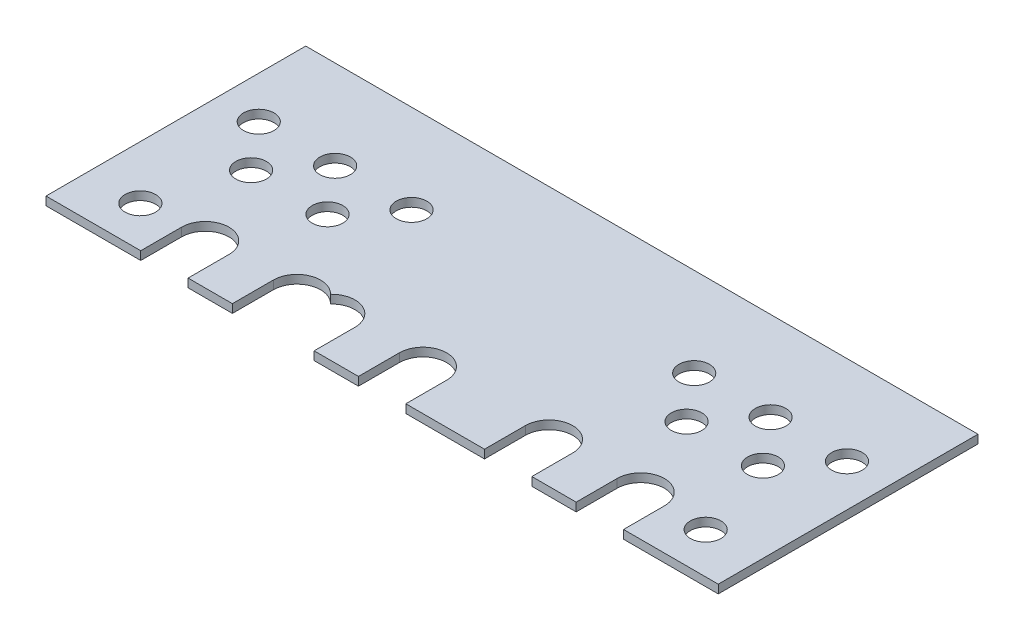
from build123d import *

# Parameters (mm, degrees)
SKETCH1_W           = 88
SKETCH1_H           = 34
BOSS_EXTRUDE1_DEPTH = 1.11
SKETCH2_R           = 2
CUT_EXTRUDE1_DEPTH  = 48.182964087
SKETCH3_R           = 2
CUT_EXTRUDE2_DEPTH  = 48.182964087
CUT_EXTRUDE3_DEPTH  = 48.182964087


with BuildPart() as part:
    # Sketch1 → Boss-Extrude1 (new body)
    with BuildSketch(Plane(origin=(0, 0, 0), x_dir=(1, 0, 0), z_dir=(0, 1, 0))):
        Rectangle(SKETCH1_W, SKETCH1_H)
    extrude(amount=BOSS_EXTRUDE1_DEPTH)

    # Sketch2 → Cut-Extrude1 (cut, through all)
    with BuildSketch(Plane(origin=(0, 1.11, 0), x_dir=(1, 0, 0), z_dir=(0, 1, 0))):
        with Locations(Location((-38.5, 5.35, 0), (0, 0, 270))):
            Circle(SKETCH2_R)
        with Locations(Location((-28.5, 5.35, 0), (0, 0, 270))):
            Circle(SKETCH2_R)
        with Locations(Location((-18.5, 5.35, 0), (0, 0, 270))):
            Circle(SKETCH2_R)
        with Locations(Location((-33.5, -0.65, 0), (0, 0, 270))):
            Circle(SKETCH2_R)
        with Locations(Location((-23.5, -0.65, 0), (0, 0, 270))):
            Circle(SKETCH2_R)
        with Locations(Location((18.5, 5.35, 0), (0, 0, 270))):
            Circle(SKETCH2_R)
        with Locations(Location((28.5, 5.35, 0), (0, 0, 270))):
            Circle(SKETCH2_R)
        with Locations(Location((38.5, 5.35, 0), (0, 0, 270))):
            Circle(SKETCH2_R)
        with Locations(Location((23.5, -0.65, 0), (0, 0, 270))):
            Circle(SKETCH2_R)
        with Locations(Location((33.5, -0.65, 0), (0, 0, 270))):
            Circle(SKETCH2_R)
    extrude(amount=-CUT_EXTRUDE1_DEPTH, mode=Mode.SUBTRACT)

    # Sketch3 → Cut-Extrude2 (cut, through all)
    with BuildSketch(Plane(origin=(0, 1.11, 0), x_dir=(1, 0, 0), z_dir=(0, 1, 0))):
        with Locations(Location((-37, -11.65, 0), (0, 0, 270))):
            Circle(SKETCH3_R)
        with Locations(Location((37, -11.65, 0), (0, 0, 270))):
            Circle(SKETCH3_R)
    extrude(amount=-CUT_EXTRUDE2_DEPTH, mode=Mode.SUBTRACT)

    # Sketch4 → Cut-Extrude3 (cut, through all)
    with BuildSketch(Plane(origin=(0, 1.11, 0), x_dir=(1, 0, 0), z_dir=(0, 1, 0))):
        with BuildLine():
            Line((-31.6, -11.65), (-31.6, -17))
            Line((-31.6, -17), (-25.4, -17))
            Line((-25.4, -17), (-25.4, -11.65))
            ThreePointArc((-25.4, -11.65), (-28.5, -8.55), (-31.6, -11.65))
        make_face()
        with BuildLine():
            Line((-19.6, -11.65), (-19.6, -17))
            Line((-19.6, -17), (-8.9, -17))
            Line((-8.9, -17), (-8.9, -11.65))
            ThreePointArc((-8.9, -11.65), (-10.852175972, -8.77032988), (-14.25, -9.517513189))
            ThreePointArc((-14.25, -9.517513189), (-17.647824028, -8.77032988), (-19.6, -11.65))
        make_face()
        with BuildLine():
            Line((13.4, -11.65), (13.4, -17))
            Line((13.4, -17), (19.6, -17))
            Line((19.6, -17), (19.6, -11.65))
            ThreePointArc((19.6, -11.65), (16.5, -8.55), (13.4, -11.65))
        make_face()
        with BuildLine():
            Line((25.4, -11.65), (25.4, -17))
            Line((25.4, -17), (31.6, -17))
            Line((31.6, -17), (31.6, -11.65))
            ThreePointArc((31.6, -11.65), (28.5, -8.55), (25.4, -11.65))
        make_face()
        with BuildLine():
            Line((-3.1, -11.65), (-3.1, -17))
            Line((-3.1, -17), (3.1, -17))
            Line((3.1, -17), (3.1, -11.65))
            ThreePointArc((3.1, -11.65), (0, -8.55), (-3.1, -11.65))
        make_face()
    extrude(amount=-CUT_EXTRUDE3_DEPTH, mode=Mode.SUBTRACT)


solid = part.part
